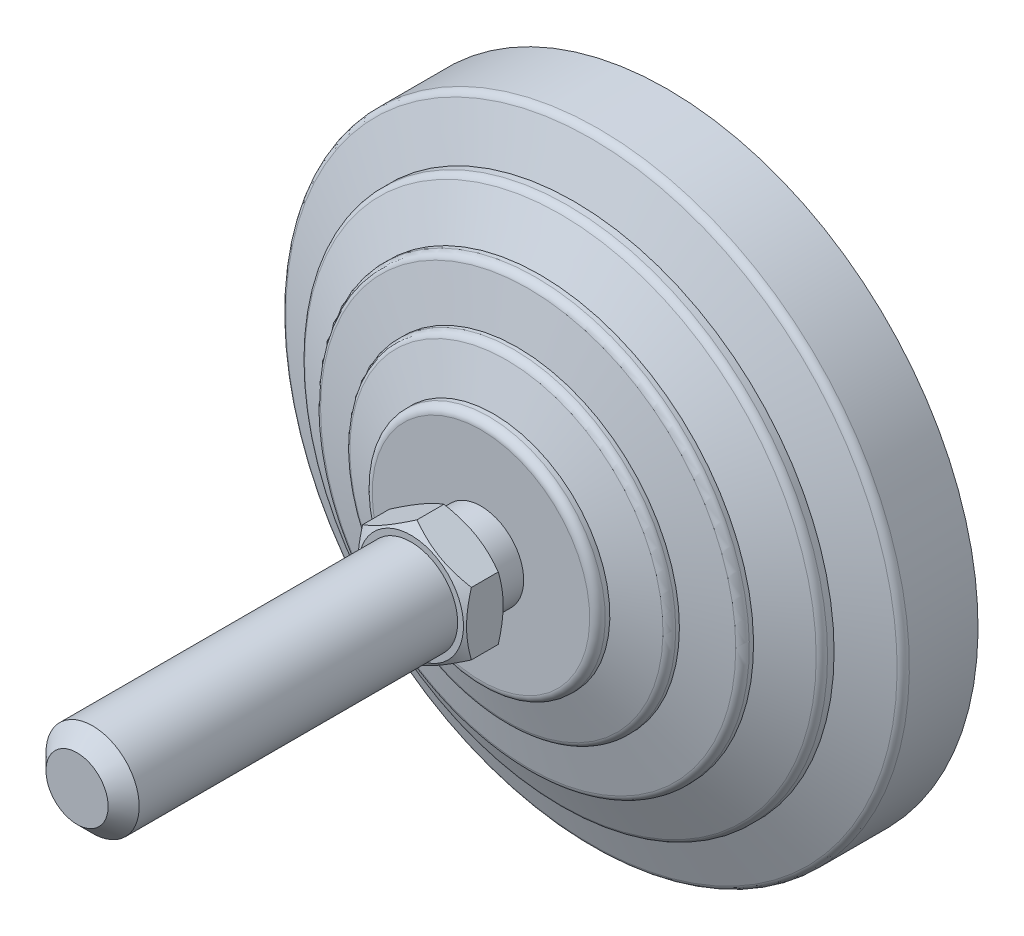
ISO-10303-21;
HEADER;
FILE_DESCRIPTION(('STEP AP214'),'2;1');
FILE_NAME('part.step','',(''),(''),'','','');
FILE_SCHEMA(('AUTOMOTIVE_DESIGN { 1 0 10303 214 1 1 1 1 }'));
ENDSEC;
DATA;
#1=APPLICATION_CONTEXT('core data for automotive mechanical design processes');
#2=APPLICATION_PROTOCOL_DEFINITION('international standard','automotive_design',2000,#1);
#3=PRODUCT_CONTEXT('',#1,'mechanical');
#4=PRODUCT('Part','Part','',(#3));
#5=PRODUCT_RELATED_PRODUCT_CATEGORY('part','',(#4));
#6=PRODUCT_DEFINITION_FORMATION('','',#4);
#7=PRODUCT_DEFINITION_CONTEXT('part definition',#1,'design');
#8=PRODUCT_DEFINITION('design','',#6,#7);
#9=PRODUCT_DEFINITION_SHAPE('','',#8);
#10=(LENGTH_UNIT() NAMED_UNIT(*) SI_UNIT(.MILLI.,.METRE.));
#11=(NAMED_UNIT(*) PLANE_ANGLE_UNIT() SI_UNIT($,.RADIAN.));
#12=(NAMED_UNIT(*) SI_UNIT($,.STERADIAN.) SOLID_ANGLE_UNIT());
#13=UNCERTAINTY_MEASURE_WITH_UNIT(LENGTH_MEASURE(1.E-05),#10,'distance_accuracy_value','');
#14=(GEOMETRIC_REPRESENTATION_CONTEXT(3) GLOBAL_UNCERTAINTY_ASSIGNED_CONTEXT((#13)) GLOBAL_UNIT_ASSIGNED_CONTEXT((#10,
#11,#12)) REPRESENTATION_CONTEXT('',''));
#15=CARTESIAN_POINT('',(0.,0.,0.));
#16=DIRECTION('',(0.,0.,1.));
#17=DIRECTION('',(1.,0.,0.));
#18=AXIS2_PLACEMENT_3D('',#15,#16,#17);
#19=CARTESIAN_POINT('',(-5.5000000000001,0.,28.));
#20=DIRECTION('',(0.,0.,1.));
#21=DIRECTION('',(0.,-1.,0.));
#22=AXIS2_PLACEMENT_3D('',#19,#20,#21);
#23=PLANE('',#22);
#24=CARTESIAN_POINT('',(0.,0.,28.));
#25=DIRECTION('',(0.,0.,-1.));
#26=DIRECTION('',(-1.,0.,0.));
#27=AXIS2_PLACEMENT_3D('',#24,#25,#26);
#28=CIRCLE('',#27,6.75);
#29=CARTESIAN_POINT('',(-6.75,0.,28.));
#30=VERTEX_POINT('',#29);
#31=EDGE_CURVE('E575',#30,#30,#28,.T.);
#32=ORIENTED_EDGE('',*,*,#31,.T.);
#33=EDGE_LOOP('',(#32));
#34=FACE_BOUND('',#33,.T.);
#35=CARTESIAN_POINT('',(0.,0.,28.));
#36=DIRECTION('',(0.,0.,-1.));
#37=DIRECTION('',(0.,1.,0.));
#38=AXIS2_PLACEMENT_3D('',#35,#36,#37);
#39=CIRCLE('',#38,5.5000000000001);
#40=CARTESIAN_POINT('',(0.,5.5000000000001,28.));
#41=VERTEX_POINT('',#40);
#42=EDGE_CURVE('E147',#41,#41,#39,.T.);
#43=ORIENTED_EDGE('',*,*,#42,.F.);
#44=EDGE_LOOP('',(#43));
#45=FACE_BOUND('',#44,.T.);
#46=ADVANCED_FACE('F14',(#34,#45),#23,.F.);
#47=CARTESIAN_POINT('',(0.,0.,0.));
#48=DIRECTION('',(0.,0.,-1.));
#49=DIRECTION('',(0.,1.,0.));
#50=AXIS2_PLACEMENT_3D('',#47,#48,#49);
#51=CYLINDRICAL_SURFACE('',#50,5.5000000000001);
#52=CARTESIAN_POINT('',(0.,0.,24.));
#53=DIRECTION('',(0.,0.,-1.));
#54=DIRECTION('',(0.,1.,0.));
#55=AXIS2_PLACEMENT_3D('',#52,#53,#54);
#56=CIRCLE('',#55,5.5000000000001);
#57=CARTESIAN_POINT('',(0.,5.5000000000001,24.));
#58=VERTEX_POINT('',#57);
#59=EDGE_CURVE('E144',#58,#58,#56,.T.);
#60=ORIENTED_EDGE('',*,*,#59,.F.);
#61=EDGE_LOOP('',(#60));
#62=FACE_BOUND('',#61,.T.);
#63=ORIENTED_EDGE('',*,*,#42,.T.);
#64=EDGE_LOOP('',(#63));
#65=FACE_BOUND('',#64,.T.);
#66=ADVANCED_FACE('F173',(#62,#65),#51,.T.);
#67=CARTESIAN_POINT('',(-5.5000000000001,0.,24.));
#68=DIRECTION('',(0.,0.,-1.));
#69=DIRECTION('',(0.,1.,0.));
#70=AXIS2_PLACEMENT_3D('',#67,#68,#69);
#71=PLANE('',#70);
#72=CARTESIAN_POINT('',(0.,0.,24.));
#73=DIRECTION('',(0.,0.,-1.));
#74=DIRECTION('',(0.,1.,0.));
#75=AXIS2_PLACEMENT_3D('',#72,#73,#74);
#76=CIRCLE('',#75,14.);
#77=CARTESIAN_POINT('',(0.,14.,24.));
#78=VERTEX_POINT('',#77);
#79=EDGE_CURVE('E141',#78,#78,#76,.T.);
#80=ORIENTED_EDGE('',*,*,#79,.F.);
#81=EDGE_LOOP('',(#80));
#82=FACE_BOUND('',#81,.T.);
#83=ORIENTED_EDGE('',*,*,#59,.T.);
#84=EDGE_LOOP('',(#83));
#85=FACE_BOUND('',#84,.T.);
#86=ADVANCED_FACE('F180',(#82,#85),#71,.F.);
#87=CARTESIAN_POINT('',(0.,0.,23.));
#88=DIRECTION('',(0.,0.,-1.));
#89=DIRECTION('',(0.,1.,0.));
#90=AXIS2_PLACEMENT_3D('',#87,#88,#89);
#91=TOROIDAL_SURFACE('',#90,14.,1.);
#92=CARTESIAN_POINT('',(0.,0.,23.));
#93=DIRECTION('',(0.,0.,-1.));
#94=DIRECTION('',(0.,1.,0.));
#95=AXIS2_PLACEMENT_3D('',#92,#93,#94);
#96=CIRCLE('',#95,15.);
#97=CARTESIAN_POINT('',(0.,15.,23.));
#98=VERTEX_POINT('',#97);
#99=EDGE_CURVE('E138',#98,#98,#96,.T.);
#100=ORIENTED_EDGE('',*,*,#99,.F.);
#101=EDGE_LOOP('',(#100));
#102=FACE_BOUND('',#101,.T.);
#103=ORIENTED_EDGE('',*,*,#79,.T.);
#104=EDGE_LOOP('',(#103));
#105=FACE_BOUND('',#104,.T.);
#106=ADVANCED_FACE('F407',(#102,#105),#91,.T.);
#107=CARTESIAN_POINT('',(0.,0.,0.));
#108=DIRECTION('',(0.,0.,-1.));
#109=DIRECTION('',(0.,1.,0.));
#110=AXIS2_PLACEMENT_3D('',#107,#108,#109);
#111=CYLINDRICAL_SURFACE('',#110,15.);
#112=CARTESIAN_POINT('',(0.,0.,22.4025287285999));
#113=DIRECTION('',(0.,0.,-1.));
#114=DIRECTION('',(0.,1.,0.));
#115=AXIS2_PLACEMENT_3D('',#112,#113,#114);
#116=CIRCLE('',#115,15.);
#117=CARTESIAN_POINT('',(0.,15.,22.4025287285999));
#118=VERTEX_POINT('',#117);
#119=EDGE_CURVE('E135',#118,#118,#116,.T.);
#120=ORIENTED_EDGE('',*,*,#119,.F.);
#121=EDGE_LOOP('',(#120));
#122=FACE_BOUND('',#121,.T.);
#123=ORIENTED_EDGE('',*,*,#99,.T.);
#124=EDGE_LOOP('',(#123));
#125=FACE_BOUND('',#124,.T.);
#126=ADVANCED_FACE('F397',(#122,#125),#111,.T.);
#127=CARTESIAN_POINT('',(0.,0.,22.4025287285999));
#128=DIRECTION('',(0.,0.,-1.));
#129=DIRECTION('',(0.,1.,0.));
#130=AXIS2_PLACEMENT_3D('',#127,#128,#129);
#131=CONICAL_SURFACE('',#130,15.,1.25589726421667);
#132=CARTESIAN_POINT('',(0.,0.,20.7216684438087));
#133=DIRECTION('',(0.,0.,-1.));
#134=DIRECTION('',(0.,1.,0.));
#135=AXIS2_PLACEMENT_3D('',#132,#133,#134);
#136=CIRCLE('',#135,20.16016354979);
#137=CARTESIAN_POINT('',(0.,20.16016354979,20.7216684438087));
#138=VERTEX_POINT('',#137);
#139=EDGE_CURVE('E132',#138,#138,#136,.T.);
#140=ORIENTED_EDGE('',*,*,#139,.F.);
#141=EDGE_LOOP('',(#140));
#142=FACE_BOUND('',#141,.T.);
#143=ORIENTED_EDGE('',*,*,#119,.T.);
#144=EDGE_LOOP('',(#143));
#145=FACE_BOUND('',#144,.T.);
#146=ADVANCED_FACE('F387',(#142,#145),#131,.T.);
#147=CARTESIAN_POINT('',(0.,0.,19.7708407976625));
#148=DIRECTION('',(0.,0.,-1.));
#149=DIRECTION('',(0.,1.,0.));
#150=AXIS2_PLACEMENT_3D('',#147,#148,#149);
#151=TOROIDAL_SURFACE('',#150,19.8504430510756,1.);
#152=CARTESIAN_POINT('',(0.,0.,19.7708407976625));
#153=DIRECTION('',(0.,0.,-1.));
#154=DIRECTION('',(0.,1.,0.));
#155=AXIS2_PLACEMENT_3D('',#152,#153,#154);
#156=CIRCLE('',#155,20.8504430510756);
#157=CARTESIAN_POINT('',(0.,20.8504430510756,19.7708407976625));
#158=VERTEX_POINT('',#157);
#159=EDGE_CURVE('E129',#158,#158,#156,.T.);
#160=ORIENTED_EDGE('',*,*,#159,.F.);
#161=EDGE_LOOP('',(#160));
#162=FACE_BOUND('',#161,.T.);
#163=ORIENTED_EDGE('',*,*,#139,.T.);
#164=EDGE_LOOP('',(#163));
#165=FACE_BOUND('',#164,.T.);
#166=ADVANCED_FACE('F377',(#162,#165),#151,.T.);
#167=CARTESIAN_POINT('',(0.,0.,0.));
#168=DIRECTION('',(0.,0.,-1.));
#169=DIRECTION('',(0.,1.,0.));
#170=AXIS2_PLACEMENT_3D('',#167,#168,#169);
#171=CYLINDRICAL_SURFACE('',#170,20.8504430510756);
#172=CARTESIAN_POINT('',(0.,0.,19.2987385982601));
#173=DIRECTION('',(0.,0.,-1.));
#174=DIRECTION('',(0.,1.,0.));
#175=AXIS2_PLACEMENT_3D('',#172,#173,#174);
#176=CIRCLE('',#175,20.8504430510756);
#177=CARTESIAN_POINT('',(0.,20.8504430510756,19.2987385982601));
#178=VERTEX_POINT('',#177);
#179=EDGE_CURVE('E126',#178,#178,#176,.T.);
#180=ORIENTED_EDGE('',*,*,#179,.F.);
#181=EDGE_LOOP('',(#180));
#182=FACE_BOUND('',#181,.T.);
#183=ORIENTED_EDGE('',*,*,#159,.T.);
#184=EDGE_LOOP('',(#183));
#185=FACE_BOUND('',#184,.T.);
#186=ADVANCED_FACE('F367',(#182,#185),#171,.T.);
#187=CARTESIAN_POINT('',(0.,0.,19.2987385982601));
#188=DIRECTION('',(0.,0.,-1.));
#189=DIRECTION('',(0.,1.,0.));
#190=AXIS2_PLACEMENT_3D('',#187,#188,#189);
#191=CONICAL_SURFACE('',#190,20.8504430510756,1.34067144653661);
#192=CARTESIAN_POINT('',(0.,0.,17.9217501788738));
#193=DIRECTION('',(0.,0.,-1.));
#194=DIRECTION('',(0.,1.,0.));
#195=AXIS2_PLACEMENT_3D('',#192,#193,#194);
#196=CIRCLE('',#195,26.7280991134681);
#197=CARTESIAN_POINT('',(0.,26.7280991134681,17.9217501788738));
#198=VERTEX_POINT('',#197);
#199=EDGE_CURVE('E123',#198,#198,#196,.T.);
#200=ORIENTED_EDGE('',*,*,#199,.F.);
#201=EDGE_LOOP('',(#200));
#202=FACE_BOUND('',#201,.T.);
#203=ORIENTED_EDGE('',*,*,#179,.T.);
#204=EDGE_LOOP('',(#203));
#205=FACE_BOUND('',#204,.T.);
#206=ADVANCED_FACE('F357',(#202,#205),#191,.T.);
#207=CARTESIAN_POINT('',(0.,0.,16.9481122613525));
#208=DIRECTION('',(0.,0.,-1.));
#209=DIRECTION('',(0.,1.,0.));
#210=AXIS2_PLACEMENT_3D('',#207,#208,#209);
#211=TOROIDAL_SURFACE('',#210,26.5,1.00000000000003);
#212=CARTESIAN_POINT('',(0.,0.,16.9481122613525));
#213=DIRECTION('',(0.,0.,-1.));
#214=DIRECTION('',(0.,1.,0.));
#215=AXIS2_PLACEMENT_3D('',#212,#213,#214);
#216=CIRCLE('',#215,27.5);
#217=CARTESIAN_POINT('',(0.,27.5,16.9481122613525));
#218=VERTEX_POINT('',#217);
#219=EDGE_CURVE('E120',#218,#218,#216,.T.);
#220=ORIENTED_EDGE('',*,*,#219,.F.);
#221=EDGE_LOOP('',(#220));
#222=FACE_BOUND('',#221,.T.);
#223=ORIENTED_EDGE('',*,*,#199,.T.);
#224=EDGE_LOOP('',(#223));
#225=FACE_BOUND('',#224,.T.);
#226=ADVANCED_FACE('F347',(#222,#225),#211,.T.);
#227=CARTESIAN_POINT('',(0.,0.,0.));
#228=DIRECTION('',(0.,0.,-1.));
#229=DIRECTION('',(0.,1.,0.));
#230=AXIS2_PLACEMENT_3D('',#227,#228,#229);
#231=CYLINDRICAL_SURFACE('',#230,27.5);
#232=CARTESIAN_POINT('',(0.,0.,16.4025287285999));
#233=DIRECTION('',(0.,0.,-1.));
#234=DIRECTION('',(0.,1.,0.));
#235=AXIS2_PLACEMENT_3D('',#232,#233,#234);
#236=CIRCLE('',#235,27.5);
#237=CARTESIAN_POINT('',(0.,27.5,16.4025287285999));
#238=VERTEX_POINT('',#237);
#239=EDGE_CURVE('E117',#238,#238,#236,.T.);
#240=ORIENTED_EDGE('',*,*,#239,.F.);
#241=EDGE_LOOP('',(#240));
#242=FACE_BOUND('',#241,.T.);
#243=ORIENTED_EDGE('',*,*,#219,.T.);
#244=EDGE_LOOP('',(#243));
#245=FACE_BOUND('',#244,.T.);
#246=ADVANCED_FACE('F337',(#242,#245),#231,.T.);
#247=CARTESIAN_POINT('',(0.,0.,16.4025287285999));
#248=DIRECTION('',(0.,0.,-1.));
#249=DIRECTION('',(0.,1.,0.));
#250=AXIS2_PLACEMENT_3D('',#247,#248,#249);
#251=CONICAL_SURFACE('',#250,27.5,1.1202291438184);
#252=CARTESIAN_POINT('',(0.,0.,13.7730910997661));
#253=DIRECTION('',(0.,0.,-1.));
#254=DIRECTION('',(0.,1.,0.));
#255=AXIS2_PLACEMENT_3D('',#252,#253,#254);
#256=CIRCLE('',#255,32.9354761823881);
#257=CARTESIAN_POINT('',(0.,32.9354761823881,13.7730910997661));
#258=VERTEX_POINT('',#257);
#259=EDGE_CURVE('E114',#258,#258,#256,.T.);
#260=ORIENTED_EDGE('',*,*,#259,.F.);
#261=EDGE_LOOP('',(#260));
#262=FACE_BOUND('',#261,.T.);
#263=ORIENTED_EDGE('',*,*,#239,.T.);
#264=EDGE_LOOP('',(#263));
#265=FACE_BOUND('',#264,.T.);
#266=ADVANCED_FACE('F327',(#262,#265),#251,.T.);
#267=CARTESIAN_POINT('',(0.,0.,12.8728908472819));
#268=DIRECTION('',(0.,0.,-1.));
#269=DIRECTION('',(0.,1.,0.));
#270=AXIS2_PLACEMENT_3D('',#267,#268,#269);
#271=TOROIDAL_SURFACE('',#270,32.5,0.999999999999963);
#272=CARTESIAN_POINT('',(0.,0.,12.8728908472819));
#273=DIRECTION('',(0.,0.,-1.));
#274=DIRECTION('',(0.,1.,0.));
#275=AXIS2_PLACEMENT_3D('',#272,#273,#274);
#276=CIRCLE('',#275,33.5);
#277=CARTESIAN_POINT('',(0.,33.5,12.8728908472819));
#278=VERTEX_POINT('',#277);
#279=EDGE_CURVE('E111',#278,#278,#276,.T.);
#280=ORIENTED_EDGE('',*,*,#279,.F.);
#281=EDGE_LOOP('',(#280));
#282=FACE_BOUND('',#281,.T.);
#283=ORIENTED_EDGE('',*,*,#259,.T.);
#284=EDGE_LOOP('',(#283));
#285=FACE_BOUND('',#284,.T.);
#286=ADVANCED_FACE('F317',(#282,#285),#271,.T.);
#287=CARTESIAN_POINT('',(0.,0.,0.));
#288=DIRECTION('',(0.,0.,-1.));
#289=DIRECTION('',(0.,1.,0.));
#290=AXIS2_PLACEMENT_3D('',#287,#288,#289);
#291=CYLINDRICAL_SURFACE('',#290,33.5);
#292=CARTESIAN_POINT('',(0.,0.,12.0315037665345));
#293=DIRECTION('',(0.,0.,-1.));
#294=DIRECTION('',(0.,1.,0.));
#295=AXIS2_PLACEMENT_3D('',#292,#293,#294);
#296=CIRCLE('',#295,33.5);
#297=CARTESIAN_POINT('',(0.,33.5,12.0315037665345));
#298=VERTEX_POINT('',#297);
#299=EDGE_CURVE('E108',#298,#298,#296,.T.);
#300=ORIENTED_EDGE('',*,*,#299,.F.);
#301=EDGE_LOOP('',(#300));
#302=FACE_BOUND('',#301,.T.);
#303=ORIENTED_EDGE('',*,*,#279,.T.);
#304=EDGE_LOOP('',(#303));
#305=FACE_BOUND('',#304,.T.);
#306=ADVANCED_FACE('F307',(#302,#305),#291,.T.);
#307=CARTESIAN_POINT('',(0.,0.,12.0315037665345));
#308=DIRECTION('',(0.,0.,-1.));
#309=DIRECTION('',(0.,1.,0.));
#310=AXIS2_PLACEMENT_3D('',#307,#308,#309);
#311=CONICAL_SURFACE('',#310,33.5,1.20362249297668);
#312=CARTESIAN_POINT('',(0.,0.,9.77805027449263));
#313=DIRECTION('',(0.,0.,-1.));
#314=DIRECTION('',(0.,1.,0.));
#315=AXIS2_PLACEMENT_3D('',#312,#313,#314);
#316=CIRCLE('',#315,39.3589790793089);
#317=CARTESIAN_POINT('',(0.,39.3589790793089,9.77805027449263));
#318=VERTEX_POINT('',#317);
#319=EDGE_CURVE('E105',#318,#318,#316,.T.);
#320=ORIENTED_EDGE('',*,*,#319,.F.);
#321=EDGE_LOOP('',(#320));
#322=FACE_BOUND('',#321,.T.);
#323=ORIENTED_EDGE('',*,*,#299,.T.);
#324=EDGE_LOOP('',(#323));
#325=FACE_BOUND('',#324,.T.);
#326=ADVANCED_FACE('F297',(#322,#325),#311,.T.);
#327=CARTESIAN_POINT('',(0.,0.,8.84470466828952));
#328=DIRECTION('',(0.,0.,-1.));
#329=DIRECTION('',(0.,1.,0.));
#330=AXIS2_PLACEMENT_3D('',#327,#328,#329);
#331=TOROIDAL_SURFACE('',#330,39.,1.00000000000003);
#332=CARTESIAN_POINT('',(0.,0.,8.84470466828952));
#333=DIRECTION('',(0.,0.,-1.));
#334=DIRECTION('',(0.,1.,0.));
#335=AXIS2_PLACEMENT_3D('',#332,#333,#334);
#336=CIRCLE('',#335,40.);
#337=CARTESIAN_POINT('',(0.,40.,8.84470466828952));
#338=VERTEX_POINT('',#337);
#339=EDGE_CURVE('E102',#338,#338,#336,.T.);
#340=ORIENTED_EDGE('',*,*,#339,.F.);
#341=EDGE_LOOP('',(#340));
#342=FACE_BOUND('',#341,.T.);
#343=ORIENTED_EDGE('',*,*,#319,.T.);
#344=EDGE_LOOP('',(#343));
#345=FACE_BOUND('',#344,.T.);
#346=ADVANCED_FACE('F287',(#342,#345),#331,.T.);
#347=CARTESIAN_POINT('',(0.,0.,0.));
#348=DIRECTION('',(0.,0.,-1.));
#349=DIRECTION('',(0.,1.,0.));
#350=AXIS2_PLACEMENT_3D('',#347,#348,#349);
#351=CYLINDRICAL_SURFACE('',#350,40.);
#352=CARTESIAN_POINT('',(0.,0.,0.));
#353=DIRECTION('',(0.,0.,-1.));
#354=DIRECTION('',(0.,1.,0.));
#355=AXIS2_PLACEMENT_3D('',#352,#353,#354);
#356=CIRCLE('',#355,40.);
#357=CARTESIAN_POINT('',(0.,40.,0.));
#358=VERTEX_POINT('',#357);
#359=EDGE_CURVE('E99',#358,#358,#356,.T.);
#360=ORIENTED_EDGE('',*,*,#359,.F.);
#361=EDGE_LOOP('',(#360));
#362=FACE_BOUND('',#361,.T.);
#363=ORIENTED_EDGE('',*,*,#339,.T.);
#364=EDGE_LOOP('',(#363));
#365=FACE_BOUND('',#364,.T.);
#366=ADVANCED_FACE('F277',(#362,#365),#351,.T.);
#367=CARTESIAN_POINT('',(0.,0.,0.));
#368=DIRECTION('',(0.,0.,1.));
#369=DIRECTION('',(0.,-1.,0.));
#370=AXIS2_PLACEMENT_3D('',#367,#368,#369);
#371=PLANE('',#370);
#372=ORIENTED_EDGE('',*,*,#359,.T.);
#373=EDGE_LOOP('',(#372));
#374=FACE_BOUND('',#373,.T.);
#375=ADVANCED_FACE('F169',(#374),#371,.F.);
#376=CARTESIAN_POINT('',(0.,0.,29.6680379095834));
#377=DIRECTION('',(0.,0.,1.));
#378=DIRECTION('',(1.,0.,0.));
#379=AXIS2_PLACEMENT_3D('',#376,#377,#378);
#380=CONICAL_SURFACE('',#379,9.63912640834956,1.0471975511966);
#381=CARTESIAN_POINT('',(0.000200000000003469,-8.0830192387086,28.7696190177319));
#382=CARTESIAN_POINT('',(-0.153667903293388,-7.99418356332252,28.7183374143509));
#383=CARTESIAN_POINT('',(-0.308109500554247,-7.90501666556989,28.669383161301));
#384=CARTESIAN_POINT('',(-0.618246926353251,-7.72595873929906,28.5767703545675));
#385=CARTESIAN_POINT('',(-0.773943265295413,-7.63606741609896,28.5331140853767));
#386=CARTESIAN_POINT('',(-1.24352516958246,-7.36495417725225,28.4109491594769));
#387=CARTESIAN_POINT('',(-1.5592643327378,-7.18266208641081,28.3414631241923));
#388=CARTESIAN_POINT('',(-2.03176224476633,-6.90986528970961,28.2599825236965));
#389=CARTESIAN_POINT('',(-2.18710922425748,-6.82017566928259,28.2367710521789));
#390=CARTESIAN_POINT('',(-2.49850511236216,-6.64039116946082,28.1978487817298));
#391=CARTESIAN_POINT('',(-2.65455395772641,-6.55029632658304,28.1821373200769));
#392=CARTESIAN_POINT('',(-2.96692267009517,-6.36995016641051,28.1586154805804));
#393=CARTESIAN_POINT('',(-3.12324202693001,-6.27969914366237,28.1507961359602));
#394=CARTESIAN_POINT('',(-3.43601650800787,-6.09911871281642,28.1432178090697));
#395=CARTESIAN_POINT('',(-3.59247162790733,-6.00878930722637,28.1434585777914));
#396=CARTESIAN_POINT('',(-4.02110687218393,-5.76131663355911,28.155197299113));
#397=CARTESIAN_POINT('',(-4.2931466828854,-5.60425437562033,28.1749033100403));
#398=CARTESIAN_POINT('',(-4.8354194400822,-5.29117305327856,28.2373910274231));
#399=CARTESIAN_POINT('',(-5.10565047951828,-5.13515508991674,28.2801940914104));
#400=CARTESIAN_POINT('',(-5.64901454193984,-4.82144370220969,28.3871892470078));
#401=CARTESIAN_POINT('',(-5.92207900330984,-4.6637898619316,28.4518346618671));
#402=CARTESIAN_POINT('',(-6.46413578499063,-4.35083323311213,28.5985536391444));
#403=CARTESIAN_POINT('',(-6.73313504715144,-4.19552643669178,28.680592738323));
#404=CARTESIAN_POINT('',(-7.0002,-4.04133641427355,28.7696190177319));
#405=B_SPLINE_CURVE_WITH_KNOTS('',3,(#381,#382,#383,#384,#385,#386,#387,#388,#389,#390,#391,
#392,#393,#394,#395,#396,#397,#398,#399,#400,#401,#402,#403,#404),.UNSPECIFIED.,.F.,.F.,(4,2,2,
2,2,2,2,2,2,2,2,4),(0.,0.554727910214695,1.10969417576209,2.2219327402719,2.76443041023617,
3.30688013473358,3.8487128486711,4.39052882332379,5.33376515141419,6.27787517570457,
7.2429241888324,8.20607866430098),.UNSPECIFIED.);
#406=CARTESIAN_POINT('',(0.,-8.08290376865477,28.7695523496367));
#407=VERTEX_POINT('',#406);
#408=CARTESIAN_POINT('',(-7.,-4.04145188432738,28.7695523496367));
#409=VERTEX_POINT('',#408);
#410=EDGE_CURVE('E73',#407,#409,#405,.T.);
#411=ORIENTED_EDGE('',*,*,#410,.T.);
#412=CARTESIAN_POINT('',(-7.,-10.8234818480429,31.5448334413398));
#413=CARTESIAN_POINT('',(-7.,-10.5180146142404,31.3967848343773));
#414=CARTESIAN_POINT('',(-7.,-10.211842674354,31.250165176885));
#415=CARTESIAN_POINT('',(-7.,-9.59771448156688,30.9605880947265));
#416=CARTESIAN_POINT('',(-7.,-9.28975795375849,30.8176312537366));
#417=CARTESIAN_POINT('',(-7.,-8.67008343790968,30.5354579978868));
#418=CARTESIAN_POINT('',(-7.,-8.35835407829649,30.3962664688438));
#419=CARTESIAN_POINT('',(-7.,-7.7324046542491,30.1236230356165));
#420=CARTESIAN_POINT('',(-7.,-7.41818470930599,29.9901708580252));
#421=CARTESIAN_POINT('',(-7.,-6.77673935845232,29.7264043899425));
#422=CARTESIAN_POINT('',(-7.,-6.44941739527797,29.5963236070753));
#423=CARTESIAN_POINT('',(-7.,-5.79093289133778,29.3460855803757));
#424=CARTESIAN_POINT('',(-7.,-5.45976992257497,29.225929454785));
#425=CARTESIAN_POINT('',(-7.,-4.79370289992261,28.9987191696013));
#426=CARTESIAN_POINT('',(-7.,-4.45880808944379,28.8916382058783));
#427=CARTESIAN_POINT('',(-7.,-3.78422694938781,28.6940341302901));
#428=CARTESIAN_POINT('',(-7.,-3.44454217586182,28.6035057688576));
#429=CARTESIAN_POINT('',(-7.,-2.76200958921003,28.4438581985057));
#430=CARTESIAN_POINT('',(-7.,-2.41918937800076,28.3746241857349));
#431=CARTESIAN_POINT('',(-7.,-1.90186328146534,28.2897576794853));
#432=CARTESIAN_POINT('',(-7.,-1.7288923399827,28.2646317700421));
#433=CARTESIAN_POINT('',(-7.,-1.38210174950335,28.2212016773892));
#434=CARTESIAN_POINT('',(-7.,-1.20828218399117,28.2028968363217));
#435=CARTESIAN_POINT('',(-7.,-0.862283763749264,28.1737014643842));
#436=CARTESIAN_POINT('',(-7.,-0.690112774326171,28.1627180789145));
#437=CARTESIAN_POINT('',(-7.,-0.345460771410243,28.148039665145));
#438=CARTESIAN_POINT('',(-7.,-0.172979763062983,28.1443445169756));
#439=CARTESIAN_POINT('',(-7.,0.171984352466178,28.1443306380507));
#440=CARTESIAN_POINT('',(-7.,0.344467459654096,28.1480119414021));
#441=CARTESIAN_POINT('',(-7.,0.689126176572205,28.1626615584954));
#442=CARTESIAN_POINT('',(-7.,0.86130177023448,28.1736302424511));
#443=CARTESIAN_POINT('',(-7.,1.27607689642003,28.2086010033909));
#444=CARTESIAN_POINT('',(-7.,1.51838644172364,28.2361153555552));
#445=CARTESIAN_POINT('',(-7.,2.0011743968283,28.3040687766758));
#446=CARTESIAN_POINT('',(-7.,2.24165254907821,28.3445096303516));
#447=CARTESIAN_POINT('',(-7.,2.96008329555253,28.4830747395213));
#448=CARTESIAN_POINT('',(-7.,3.43475744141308,28.5984153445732));
#449=CARTESIAN_POINT('',(-7.,4.14448104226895,28.7980159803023));
#450=CARTESIAN_POINT('',(-7.,4.38322207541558,28.8699012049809));
#451=CARTESIAN_POINT('',(-7.,4.85838459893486,29.0210356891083));
#452=CARTESIAN_POINT('',(-7.,5.09480607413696,29.1002849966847));
#453=CARTESIAN_POINT('',(-7.,5.56540584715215,29.2648846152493));
#454=CARTESIAN_POINT('',(-7.,5.79958487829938,29.3502328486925));
#455=CARTESIAN_POINT('',(-7.,6.26600957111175,29.5260363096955));
#456=CARTESIAN_POINT('',(-7.,6.49825525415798,29.6164914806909));
#457=CARTESIAN_POINT('',(-7.,7.04118817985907,29.8337326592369));
#458=CARTESIAN_POINT('',(-7.,7.35118126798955,29.9622501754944));
#459=CARTESIAN_POINT('',(-7.,7.96857654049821,30.2253821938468));
#460=CARTESIAN_POINT('',(-7.,8.27597857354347,30.3599970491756));
#461=CARTESIAN_POINT('',(-7.,8.88866156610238,30.6341136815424));
#462=CARTESIAN_POINT('',(-7.,9.19394210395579,30.773616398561));
#463=CARTESIAN_POINT('',(-7.,9.80268418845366,31.0565425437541));
#464=CARTESIAN_POINT('',(-7.,10.1061456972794,31.199966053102));
#465=CARTESIAN_POINT('',(-7.,10.7118512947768,31.4901531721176));
#466=CARTESIAN_POINT('',(-7.,11.0140937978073,31.6369200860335));
#467=CARTESIAN_POINT('',(-7.,11.6172863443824,31.9330886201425));
#468=CARTESIAN_POINT('',(-7.,11.9182363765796,32.0824902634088));
#469=CARTESIAN_POINT('',(-7.,12.8193764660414,32.5339155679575));
#470=CARTESIAN_POINT('',(-7.,13.4179343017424,32.8391971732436));
#471=CARTESIAN_POINT('',(-7.,14.5626517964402,33.4304667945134));
#472=CARTESIAN_POINT('',(-7.,15.1090628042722,33.7159703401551));
#473=CARTESIAN_POINT('',(-7.,16.199850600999,34.2908789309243));
#474=CARTESIAN_POINT('',(-7.,16.7442273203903,34.5802841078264));
#475=CARTESIAN_POINT('',(-7.,17.8300738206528,35.1613666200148));
#476=CARTESIAN_POINT('',(-7.,18.37154744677,35.4530367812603));
#477=CARTESIAN_POINT('',(-7.,19.4531911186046,36.03871640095));
#478=CARTESIAN_POINT('',(-7.,19.9933612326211,36.3327257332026));
#479=CARTESIAN_POINT('',(-7.,20.5330501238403,36.6276098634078));
#480=B_SPLINE_CURVE_WITH_KNOTS('',3,(#412,#413,#414,#415,#416,#417,#418,#419,#420,#421,#422,
#423,#424,#425,#426,#427,#428,#429,#430,#431,#432,#433,#434,#435,#436,#437,#438,#439,#440,#441,
#442,#443,#444,#445,#446,#447,#448,#449,#450,#451,#452,#453,#454,#455,#456,#457,#458,#459,#460,
#461,#462,#463,#464,#465,#466,#467,#468,#469,#470,#471,#472,#473,#474,#475,#476,#477,#478,#479),
.UNSPECIFIED.,.F.,.F.,(4,2,2,2,2,2,2,2,2,2,2,2,2,2,2,2,2,2,2,2,2,2,2,2,2,2,2,2,2,2,2,2,2,4),(0.,
1.01837283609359,2.03690695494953,3.06104090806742,4.08512602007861,5.14166861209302,
6.19833008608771,7.25278767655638,8.30691026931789,9.3552459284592,9.87949154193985,
10.403686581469,10.9211001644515,11.4385052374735,11.9559127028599,12.4733464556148,
13.2045326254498,13.9358197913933,15.3992183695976,16.1471431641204,16.8950728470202,
17.6427489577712,18.3904167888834,19.3970628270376,20.4037672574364,21.4106663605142,
22.4175863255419,23.4255487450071,24.4335199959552,26.4492033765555,28.2986987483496,
30.1482567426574,31.993348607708,33.8383416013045),.UNSPECIFIED.);
#481=CARTESIAN_POINT('',(-7.,4.04145188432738,28.7695523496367));
#482=VERTEX_POINT('',#481);
#483=EDGE_CURVE('E81',#409,#482,#480,.T.);
#484=ORIENTED_EDGE('',*,*,#483,.T.);
#485=CARTESIAN_POINT('',(-7.0002,4.04133641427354,28.7696190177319));
#486=CARTESIAN_POINT('',(-6.84633209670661,4.13017208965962,28.7183374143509));
#487=CARTESIAN_POINT('',(-6.69189049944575,4.21933898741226,28.669383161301));
#488=CARTESIAN_POINT('',(-6.38175307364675,4.39839691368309,28.5767703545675));
#489=CARTESIAN_POINT('',(-6.22605673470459,4.48828823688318,28.5331140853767));
#490=CARTESIAN_POINT('',(-5.75647483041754,4.75940147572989,28.4109491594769));
#491=CARTESIAN_POINT('',(-5.4407356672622,4.94169356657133,28.3414631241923));
#492=CARTESIAN_POINT('',(-4.96823775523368,5.21449036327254,28.2599825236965));
#493=CARTESIAN_POINT('',(-4.81289077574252,5.30417998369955,28.2367710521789));
#494=CARTESIAN_POINT('',(-4.50149488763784,5.48396448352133,28.1978487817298));
#495=CARTESIAN_POINT('',(-4.3454460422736,5.57405932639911,28.1821373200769));
#496=CARTESIAN_POINT('',(-4.03307732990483,5.75440548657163,28.1586154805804));
#497=CARTESIAN_POINT('',(-3.87675797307,5.84465650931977,28.1507961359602));
#498=CARTESIAN_POINT('',(-3.56398349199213,6.02523694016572,28.1432178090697));
#499=CARTESIAN_POINT('',(-3.40752837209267,6.11556634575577,28.1434585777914));
#500=CARTESIAN_POINT('',(-2.97889312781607,6.36303901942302,28.155197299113));
#501=CARTESIAN_POINT('',(-2.7068533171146,6.52010127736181,28.1749033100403));
#502=CARTESIAN_POINT('',(-2.1645805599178,6.83318259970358,28.2373910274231));
#503=CARTESIAN_POINT('',(-1.89434952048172,6.9892005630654,28.2801940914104));
#504=CARTESIAN_POINT('',(-1.35098545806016,7.30291195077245,28.3871892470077));
#505=CARTESIAN_POINT('',(-1.07792099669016,7.46056579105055,28.451834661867));
#506=CARTESIAN_POINT('',(-0.53586421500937,7.77352241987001,28.5985536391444));
#507=CARTESIAN_POINT('',(-0.266864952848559,7.92882921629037,28.680592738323));
#508=CARTESIAN_POINT('',(0.000199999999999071,8.0830192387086,28.7696190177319));
#509=B_SPLINE_CURVE_WITH_KNOTS('',3,(#485,#486,#487,#488,#489,#490,#491,#492,#493,#494,#495,
#496,#497,#498,#499,#500,#501,#502,#503,#504,#505,#506,#507,#508),.UNSPECIFIED.,.F.,.F.,(4,2,2,
2,2,2,2,2,2,2,2,4),(0.,0.554727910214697,1.10969417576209,2.2219327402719,2.76443041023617,
3.30688013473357,3.8487128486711,4.39052882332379,5.33376515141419,6.27787517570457,
7.2429241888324,8.20607866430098),.UNSPECIFIED.);
#510=CARTESIAN_POINT('',(0.,8.08290376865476,28.7695523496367));
#511=VERTEX_POINT('',#510);
#512=EDGE_CURVE('E530',#482,#511,#509,.T.);
#513=ORIENTED_EDGE('',*,*,#512,.T.);
#514=CARTESIAN_POINT('',(-0.000200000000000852,8.0830192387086,28.7696190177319));
#515=CARTESIAN_POINT('',(0.153667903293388,7.99418356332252,28.7183374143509));
#516=CARTESIAN_POINT('',(0.308109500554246,7.90501666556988,28.669383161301));
#517=CARTESIAN_POINT('',(0.61824692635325,7.72595873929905,28.5767703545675));
#518=CARTESIAN_POINT('',(0.773943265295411,7.63606741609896,28.5331140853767));
#519=CARTESIAN_POINT('',(1.24352516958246,7.36495417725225,28.4109491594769));
#520=CARTESIAN_POINT('',(1.5592643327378,7.18266208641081,28.3414631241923));
#521=CARTESIAN_POINT('',(2.03176224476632,6.9098652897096,28.2599825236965));
#522=CARTESIAN_POINT('',(2.18710922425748,6.82017566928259,28.2367710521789));
#523=CARTESIAN_POINT('',(2.49850511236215,6.64039116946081,28.1978487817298));
#524=CARTESIAN_POINT('',(2.6545539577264,6.55029632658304,28.1821373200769));
#525=CARTESIAN_POINT('',(2.96692267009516,6.36995016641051,28.1586154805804));
#526=CARTESIAN_POINT('',(3.12324202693,6.27969914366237,28.1507961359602));
#527=CARTESIAN_POINT('',(3.43601650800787,6.09911871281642,28.1432178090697));
#528=CARTESIAN_POINT('',(3.59247162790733,6.00878930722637,28.1434585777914));
#529=CARTESIAN_POINT('',(4.02110687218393,5.76131663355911,28.155197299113));
#530=CARTESIAN_POINT('',(4.29314668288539,5.60425437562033,28.1749033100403));
#531=CARTESIAN_POINT('',(4.83541944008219,5.29117305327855,28.2373910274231));
#532=CARTESIAN_POINT('',(5.10565047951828,5.13515508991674,28.2801940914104));
#533=CARTESIAN_POINT('',(5.64901454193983,4.82144370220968,28.3871892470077));
#534=CARTESIAN_POINT('',(5.92207900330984,4.66378986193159,28.4518346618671));
#535=CARTESIAN_POINT('',(6.46413578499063,4.35083323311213,28.5985536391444));
#536=CARTESIAN_POINT('',(6.73313504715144,4.19552643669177,28.680592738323));
#537=CARTESIAN_POINT('',(7.0002,4.04133641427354,28.7696190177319));
#538=B_SPLINE_CURVE_WITH_KNOTS('',3,(#514,#515,#516,#517,#518,#519,#520,#521,#522,#523,#524,
#525,#526,#527,#528,#529,#530,#531,#532,#533,#534,#535,#536,#537),.UNSPECIFIED.,.F.,.F.,(4,2,2,
2,2,2,2,2,2,2,2,4),(0.,0.554727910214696,1.10969417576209,2.2219327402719,2.76443041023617,
3.30688013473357,3.84871284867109,4.39052882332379,5.33376515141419,6.27787517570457,
7.2429241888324,8.20607866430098),.UNSPECIFIED.);
#539=CARTESIAN_POINT('',(7.,4.04145188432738,28.7695523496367));
#540=VERTEX_POINT('',#539);
#541=EDGE_CURVE('E525',#511,#540,#538,.T.);
#542=ORIENTED_EDGE('',*,*,#541,.T.);
#543=CARTESIAN_POINT('',(7.,-10.823481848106,31.5448334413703));
#544=CARTESIAN_POINT('',(7.,-10.5180146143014,31.3967848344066));
#545=CARTESIAN_POINT('',(7.,-10.2118426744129,31.250165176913));
#546=CARTESIAN_POINT('',(7.,-9.59771448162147,30.9605880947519));
#547=CARTESIAN_POINT('',(7.,-9.28975795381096,30.8176312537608));
#548=CARTESIAN_POINT('',(7.,-8.67008343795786,30.5354579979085));
#549=CARTESIAN_POINT('',(7.,-8.3583540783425,30.3962664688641));
#550=CARTESIAN_POINT('',(7.,-7.73240465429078,30.1236230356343));
#551=CARTESIAN_POINT('',(7.,-7.4181847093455,29.9901708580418));
#552=CARTESIAN_POINT('',(7.,-6.77673935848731,29.7264043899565));
#553=CARTESIAN_POINT('',(7.,-6.44941739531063,29.5963236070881));
#554=CARTESIAN_POINT('',(7.,-5.79093289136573,29.346085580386));
#555=CARTESIAN_POINT('',(7.,-5.45976992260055,29.225929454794));
#556=CARTESIAN_POINT('',(7.,-4.79370289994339,28.998719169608));
#557=CARTESIAN_POINT('',(7.,-4.45880808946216,28.891638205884));
#558=CARTESIAN_POINT('',(7.,-3.78422694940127,28.6940341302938));
#559=CARTESIAN_POINT('',(7.,-3.4445421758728,28.6035057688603));
#560=CARTESIAN_POINT('',(7.,-2.76200958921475,28.4438581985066));
#561=CARTESIAN_POINT('',(7.,-2.41918937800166,28.374624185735));
#562=CARTESIAN_POINT('',(7.,-1.90186328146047,28.2897576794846));
#563=CARTESIAN_POINT('',(7.,-1.72889233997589,28.2646317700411));
#564=CARTESIAN_POINT('',(7.,-1.38210174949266,28.2212016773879));
#565=CARTESIAN_POINT('',(7.,-1.20828218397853,28.2028968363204));
#566=CARTESIAN_POINT('',(7.,-0.862283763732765,28.173701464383));
#567=CARTESIAN_POINT('',(7.,-0.690112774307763,28.1627180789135));
#568=CARTESIAN_POINT('',(7.,-0.34546077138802,28.1480396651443));
#569=CARTESIAN_POINT('',(7.,-0.172979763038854,28.1443445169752));
#570=CARTESIAN_POINT('',(7.,0.171984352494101,28.144330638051));
#571=CARTESIAN_POINT('',(7.,0.344467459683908,28.148011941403));
#572=CARTESIAN_POINT('',(7.,0.689126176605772,28.1626615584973));
#573=CARTESIAN_POINT('',(7.,0.861301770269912,28.1736302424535));
#574=CARTESIAN_POINT('',(7.,1.27607689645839,28.2086010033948));
#575=CARTESIAN_POINT('',(7.,1.51838644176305,28.23611535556));
#576=CARTESIAN_POINT('',(7.,2.00117439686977,28.3040687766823));
#577=CARTESIAN_POINT('',(7.,2.24165254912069,28.3445096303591));
#578=CARTESIAN_POINT('',(7.,2.96008329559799,28.4830747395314));
#579=CARTESIAN_POINT('',(7.,3.43475744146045,28.5984153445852));
#580=CARTESIAN_POINT('',(7.,4.14448104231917,28.7980159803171));
#581=CARTESIAN_POINT('',(7.,4.38322207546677,28.8699012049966));
#582=CARTESIAN_POINT('',(7.,4.85838459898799,29.0210356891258));
#583=CARTESIAN_POINT('',(7.,5.09480607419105,29.1002849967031));
#584=CARTESIAN_POINT('',(7.,5.56540584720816,29.2648846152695));
#585=CARTESIAN_POINT('',(7.,5.79958487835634,29.3502328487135));
#586=CARTESIAN_POINT('',(7.,6.26600957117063,29.5260363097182));
#587=CARTESIAN_POINT('',(7.,6.49825525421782,29.6164914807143));
#588=CARTESIAN_POINT('',(7.,7.04118817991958,29.8337326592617));
#589=CARTESIAN_POINT('',(7.,7.35118126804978,29.9622501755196));
#590=CARTESIAN_POINT('',(7.,7.96857654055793,30.2253821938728));
#591=CARTESIAN_POINT('',(7.,8.27597857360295,30.3599970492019));
#592=CARTESIAN_POINT('',(7.,8.88866156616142,30.6341136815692));
#593=CARTESIAN_POINT('',(7.,9.19394210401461,30.773616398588));
#594=CARTESIAN_POINT('',(7.,9.80268418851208,31.0565425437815));
#595=CARTESIAN_POINT('',(7.,10.1061456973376,31.1999660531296));
#596=CARTESIAN_POINT('',(7.,10.7118512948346,31.4901531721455));
#597=CARTESIAN_POINT('',(7.,11.0140937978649,31.6369200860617));
#598=CARTESIAN_POINT('',(7.,11.6172863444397,31.9330886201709));
#599=CARTESIAN_POINT('',(7.,11.9182363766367,32.0824902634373));
#600=CARTESIAN_POINT('',(7.,12.8193764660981,32.5339155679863));
#601=CARTESIAN_POINT('',(7.,13.4179343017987,32.8391971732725));
#602=CARTESIAN_POINT('',(7.,14.5626517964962,33.4304667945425));
#603=CARTESIAN_POINT('',(7.,15.1090628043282,33.7159703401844));
#604=CARTESIAN_POINT('',(7.,16.1998506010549,34.290878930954));
#605=CARTESIAN_POINT('',(7.,16.7442273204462,34.5802841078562));
#606=CARTESIAN_POINT('',(7.,17.8300738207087,35.1613666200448));
#607=CARTESIAN_POINT('',(7.,18.371547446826,35.4530367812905));
#608=CARTESIAN_POINT('',(7.,19.4531911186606,36.0387164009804));
#609=CARTESIAN_POINT('',(7.,19.9933612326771,36.3327257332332));
#610=CARTESIAN_POINT('',(7.,20.5330501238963,36.6276098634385));
#611=B_SPLINE_CURVE_WITH_KNOTS('',3,(#543,#544,#545,#546,#547,#548,#549,#550,#551,#552,#553,
#554,#555,#556,#557,#558,#559,#560,#561,#562,#563,#564,#565,#566,#567,#568,#569,#570,#571,#572,
#573,#574,#575,#576,#577,#578,#579,#580,#581,#582,#583,#584,#585,#586,#587,#588,#589,#590,#591,
#592,#593,#594,#595,#596,#597,#598,#599,#600,#601,#602,#603,#604,#605,#606,#607,#608,#609,#610),
.UNSPECIFIED.,.F.,.F.,(4,2,2,2,2,2,2,2,2,2,2,2,2,2,2,2,2,2,2,2,2,2,2,2,2,2,2,2,2,2,2,2,2,4),(0.,
1.01837283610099,2.03690695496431,3.06104090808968,4.08512602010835,5.14166861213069,
6.19833008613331,7.25278767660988,8.30691026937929,9.35524592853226,9.87949154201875,
10.4036865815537,10.9211001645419,11.4385052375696,11.9559127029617,12.4733464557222,
13.2045326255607,13.9358197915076,15.3992183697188,16.1471431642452,16.8950728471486,
17.6427489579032,18.3904167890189,19.3970628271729,20.4037672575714,21.4106663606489,
22.4175863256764,23.4255487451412,24.433519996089,26.4492033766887,28.298698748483,
30.1482567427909,31.9933486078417,33.8383416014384),.UNSPECIFIED.);
#612=CARTESIAN_POINT('',(7.,-4.04145188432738,28.7695523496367));
#613=VERTEX_POINT('',#612);
#614=EDGE_CURVE('E34',#540,#613,#611,.F.);
#615=ORIENTED_EDGE('',*,*,#614,.T.);
#616=CARTESIAN_POINT('',(7.0002,-4.04133641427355,28.7696190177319));
#617=CARTESIAN_POINT('',(6.84633209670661,-4.13017208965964,28.7183374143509));
#618=CARTESIAN_POINT('',(6.69189049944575,-4.21933898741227,28.669383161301));
#619=CARTESIAN_POINT('',(6.38175307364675,-4.3983969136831,28.5767703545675));
#620=CARTESIAN_POINT('',(6.22605673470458,-4.4882882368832,28.5331140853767));
#621=CARTESIAN_POINT('',(5.75647483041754,-4.7594014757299,28.4109491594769));
#622=CARTESIAN_POINT('',(5.4407356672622,-4.94169356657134,28.3414631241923));
#623=CARTESIAN_POINT('',(4.96823775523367,-5.21449036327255,28.2599825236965));
#624=CARTESIAN_POINT('',(4.81289077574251,-5.30417998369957,28.2367710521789));
#625=CARTESIAN_POINT('',(4.50149488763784,-5.48396448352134,28.1978487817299));
#626=CARTESIAN_POINT('',(4.34544604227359,-5.57405932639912,28.1821373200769));
#627=CARTESIAN_POINT('',(4.03307732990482,-5.75440548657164,28.1586154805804));
#628=CARTESIAN_POINT('',(3.87675797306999,-5.84465650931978,28.1507961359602));
#629=CARTESIAN_POINT('',(3.56398349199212,-6.02523694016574,28.1432178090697));
#630=CARTESIAN_POINT('',(3.40752837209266,-6.11556634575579,28.1434585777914));
#631=CARTESIAN_POINT('',(2.97889312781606,-6.36303901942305,28.155197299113));
#632=CARTESIAN_POINT('',(2.7068533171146,-6.52010127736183,28.1749033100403));
#633=CARTESIAN_POINT('',(2.1645805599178,-6.8331825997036,28.2373910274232));
#634=CARTESIAN_POINT('',(1.89434952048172,-6.98920056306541,28.2801940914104));
#635=CARTESIAN_POINT('',(1.35098545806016,-7.30291195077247,28.3871892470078));
#636=CARTESIAN_POINT('',(1.07792099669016,-7.46056579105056,28.4518346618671));
#637=CARTESIAN_POINT('',(0.535864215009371,-7.77352241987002,28.5985536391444));
#638=CARTESIAN_POINT('',(0.266864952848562,-7.92882921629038,28.680592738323));
#639=CARTESIAN_POINT('',(-0.00019999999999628,-8.08301923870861,28.7696190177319));
#640=B_SPLINE_CURVE_WITH_KNOTS('',3,(#616,#617,#618,#619,#620,#621,#622,#623,#624,#625,#626,
#627,#628,#629,#630,#631,#632,#633,#634,#635,#636,#637,#638,#639),.UNSPECIFIED.,.F.,.F.,(4,2,2,
2,2,2,2,2,2,2,2,4),(0.,0.554727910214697,1.10969417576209,2.2219327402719,2.76443041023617,
3.30688013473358,3.8487128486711,4.3905288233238,5.33376515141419,6.27787517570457,
7.2429241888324,8.20607866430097),.UNSPECIFIED.);
#641=EDGE_CURVE('E9',#613,#407,#640,.T.);
#642=ORIENTED_EDGE('',*,*,#641,.T.);
#643=EDGE_LOOP('',(#411,#484,#513,#542,#615,#642));
#644=FACE_BOUND('',#643,.T.);
#645=ORIENTED_EDGE('',*,*,#31,.F.);
#646=EDGE_LOOP('',(#645));
#647=FACE_BOUND('',#646,.T.);
#648=ADVANCED_FACE('F71',(#644,#647),#380,.T.);
#649=CARTESIAN_POINT('',(-4.,0.,76.));
#650=DIRECTION('',(0.,0.,-1.));
#651=DIRECTION('',(0.,1.,0.));
#652=AXIS2_PLACEMENT_3D('',#649,#650,#651);
#653=PLANE('',#652);
#654=CARTESIAN_POINT('',(0.,0.,76.));
#655=DIRECTION('',(0.,0.,-1.));
#656=DIRECTION('',(0.,1.,0.));
#657=AXIS2_PLACEMENT_3D('',#654,#655,#656);
#658=CIRCLE('',#657,4.);
#659=CARTESIAN_POINT('',(0.,4.,76.));
#660=VERTEX_POINT('',#659);
#661=EDGE_CURVE('E96',#660,#660,#658,.T.);
#662=ORIENTED_EDGE('',*,*,#661,.F.);
#663=EDGE_LOOP('',(#662));
#664=FACE_BOUND('',#663,.T.);
#665=ADVANCED_FACE('F159',(#664),#653,.F.);
#666=CARTESIAN_POINT('',(0.,0.,76.));
#667=DIRECTION('',(0.,0.,-1.));
#668=DIRECTION('',(0.,1.,0.));
#669=AXIS2_PLACEMENT_3D('',#666,#667,#668);
#670=CONICAL_SURFACE('',#669,4.,0.785398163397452);
#671=CARTESIAN_POINT('',(0.,0.,74.));
#672=DIRECTION('',(0.,0.,-1.));
#673=DIRECTION('',(0.,1.,0.));
#674=AXIS2_PLACEMENT_3D('',#671,#672,#673);
#675=CIRCLE('',#674,6.);
#676=CARTESIAN_POINT('',(0.,6.,74.));
#677=VERTEX_POINT('',#676);
#678=EDGE_CURVE('E28',#677,#677,#675,.T.);
#679=ORIENTED_EDGE('',*,*,#678,.F.);
#680=EDGE_LOOP('',(#679));
#681=FACE_BOUND('',#680,.T.);
#682=ORIENTED_EDGE('',*,*,#661,.T.);
#683=EDGE_LOOP('',(#682));
#684=FACE_BOUND('',#683,.T.);
#685=ADVANCED_FACE('F16',(#681,#684),#670,.T.);
#686=CARTESIAN_POINT('',(0.,0.,0.));
#687=DIRECTION('',(0.,0.,-1.));
#688=DIRECTION('',(0.,1.,0.));
#689=AXIS2_PLACEMENT_3D('',#686,#687,#688);
#690=CYLINDRICAL_SURFACE('',#689,6.);
#691=CARTESIAN_POINT('',(0.,0.,33.));
#692=DIRECTION('',(0.,0.,-1.));
#693=DIRECTION('',(0.,1.,0.));
#694=AXIS2_PLACEMENT_3D('',#691,#692,#693);
#695=CIRCLE('',#694,6.);
#696=CARTESIAN_POINT('',(0.,6.,33.));
#697=VERTEX_POINT('',#696);
#698=EDGE_CURVE('E150',#697,#697,#695,.T.);
#699=ORIENTED_EDGE('',*,*,#698,.F.);
#700=EDGE_LOOP('',(#699));
#701=FACE_BOUND('',#700,.T.);
#702=ORIENTED_EDGE('',*,*,#678,.T.);
#703=EDGE_LOOP('',(#702));
#704=FACE_BOUND('',#703,.T.);
#705=ADVANCED_FACE('F155',(#701,#704),#690,.T.);
#706=CARTESIAN_POINT('',(-6.,0.,33.));
#707=DIRECTION('',(0.,0.,-1.));
#708=DIRECTION('',(0.,1.,0.));
#709=AXIS2_PLACEMENT_3D('',#706,#707,#708);
#710=PLANE('',#709);
#711=CARTESIAN_POINT('',(0.,0.,33.));
#712=DIRECTION('',(0.,0.,-1.));
#713=DIRECTION('',(-1.,0.,0.));
#714=AXIS2_PLACEMENT_3D('',#711,#712,#713);
#715=CIRCLE('',#714,6.75);
#716=CARTESIAN_POINT('',(-6.75,0.,33.));
#717=VERTEX_POINT('',#716);
#718=EDGE_CURVE('E80',#717,#717,#715,.T.);
#719=ORIENTED_EDGE('',*,*,#718,.F.);
#720=EDGE_LOOP('',(#719));
#721=FACE_BOUND('',#720,.T.);
#722=ORIENTED_EDGE('',*,*,#698,.T.);
#723=EDGE_LOOP('',(#722));
#724=FACE_BOUND('',#723,.T.);
#725=ADVANCED_FACE('F187',(#721,#724),#710,.F.);
#726=CARTESIAN_POINT('',(0.,0.,33.));
#727=DIRECTION('',(0.,0.,-1.));
#728=DIRECTION('',(-1.,0.,0.));
#729=AXIS2_PLACEMENT_3D('',#726,#727,#728);
#730=CONICAL_SURFACE('',#729,6.75,1.0471975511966);
#731=CARTESIAN_POINT('',(-7.0002,-4.04133641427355,32.2303809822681));
#732=CARTESIAN_POINT('',(-6.84633209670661,-4.13017208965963,32.2816625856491));
#733=CARTESIAN_POINT('',(-6.69189049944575,-4.21933898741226,32.330616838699));
#734=CARTESIAN_POINT('',(-6.38175307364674,-4.3983969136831,32.4232296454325));
#735=CARTESIAN_POINT('',(-6.22605673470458,-4.48828823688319,32.4668859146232));
#736=CARTESIAN_POINT('',(-5.75647483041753,-4.7594014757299,32.5890508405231));
#737=CARTESIAN_POINT('',(-5.4407356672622,-4.94169356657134,32.6585368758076));
#738=CARTESIAN_POINT('',(-4.96823775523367,-5.21449036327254,32.7400174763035));
#739=CARTESIAN_POINT('',(-4.81289077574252,-5.30417998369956,32.7632289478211));
#740=CARTESIAN_POINT('',(-4.50149488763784,-5.48396448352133,32.8021512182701));
#741=CARTESIAN_POINT('',(-4.34544604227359,-5.57405932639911,32.8178626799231));
#742=CARTESIAN_POINT('',(-4.03307732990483,-5.75440548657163,32.8413845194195));
#743=CARTESIAN_POINT('',(-3.87675797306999,-5.84465650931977,32.8492038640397));
#744=CARTESIAN_POINT('',(-3.56398349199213,-6.02523694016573,32.8567821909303));
#745=CARTESIAN_POINT('',(-3.40752837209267,-6.11556634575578,32.8565414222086));
#746=CARTESIAN_POINT('',(-2.97889312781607,-6.36303901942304,32.844802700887));
#747=CARTESIAN_POINT('',(-2.70685331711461,-6.52010127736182,32.8250966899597));
#748=CARTESIAN_POINT('',(-2.1645805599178,-6.83318259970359,32.7626089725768));
#749=CARTESIAN_POINT('',(-1.89434952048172,-6.9892005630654,32.7198059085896));
#750=CARTESIAN_POINT('',(-1.35098545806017,-7.30291195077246,32.6128107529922));
#751=CARTESIAN_POINT('',(-1.07792099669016,-7.46056579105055,32.5481653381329));
#752=CARTESIAN_POINT('',(-0.535864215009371,-7.77352241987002,32.4014463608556));
#753=CARTESIAN_POINT('',(-0.266864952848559,-7.92882921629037,32.319407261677));
#754=CARTESIAN_POINT('',(0.000200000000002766,-8.0830192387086,32.2303809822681));
#755=B_SPLINE_CURVE_WITH_KNOTS('',3,(#731,#732,#733,#734,#735,#736,#737,#738,#739,#740,#741,
#742,#743,#744,#745,#746,#747,#748,#749,#750,#751,#752,#753,#754),.UNSPECIFIED.,.F.,.F.,(4,2,2,
2,2,2,2,2,2,2,2,4),(0.,0.554727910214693,1.10969417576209,2.22193274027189,2.76443041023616,
3.30688013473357,3.84871284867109,4.39052882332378,5.33376515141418,6.27787517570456,
7.2429241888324,8.20607866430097),.UNSPECIFIED.);
#756=CARTESIAN_POINT('',(-7.,-4.04145188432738,32.2304476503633));
#757=VERTEX_POINT('',#756);
#758=CARTESIAN_POINT('',(0.,-8.08290376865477,32.2304476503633));
#759=VERTEX_POINT('',#758);
#760=EDGE_CURVE('E88',#757,#759,#755,.T.);
#761=ORIENTED_EDGE('',*,*,#760,.T.);
#762=CARTESIAN_POINT('',(-0.000199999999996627,-8.08301923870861,32.2303809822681));
#763=CARTESIAN_POINT('',(0.153667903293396,-7.99418356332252,32.2816625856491));
#764=CARTESIAN_POINT('',(0.308109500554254,-7.90501666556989,32.330616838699));
#765=CARTESIAN_POINT('',(0.618246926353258,-7.72595873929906,32.4232296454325));
#766=CARTESIAN_POINT('',(0.773943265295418,-7.63606741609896,32.4668859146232));
#767=CARTESIAN_POINT('',(1.24352516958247,-7.36495417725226,32.5890508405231));
#768=CARTESIAN_POINT('',(1.5592643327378,-7.18266208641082,32.6585368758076));
#769=CARTESIAN_POINT('',(2.03176224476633,-6.90986528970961,32.7400174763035));
#770=CARTESIAN_POINT('',(2.18710922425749,-6.8201756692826,32.7632289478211));
#771=CARTESIAN_POINT('',(2.49850511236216,-6.64039116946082,32.8021512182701));
#772=CARTESIAN_POINT('',(2.65455395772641,-6.55029632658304,32.8178626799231));
#773=CARTESIAN_POINT('',(2.96692267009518,-6.36995016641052,32.8413845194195));
#774=CARTESIAN_POINT('',(3.12324202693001,-6.27969914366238,32.8492038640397));
#775=CARTESIAN_POINT('',(3.43601650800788,-6.09911871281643,32.8567821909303));
#776=CARTESIAN_POINT('',(3.59247162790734,-6.00878930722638,32.8565414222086));
#777=CARTESIAN_POINT('',(4.02110687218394,-5.76131663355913,32.844802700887));
#778=CARTESIAN_POINT('',(4.2931466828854,-5.60425437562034,32.8250966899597));
#779=CARTESIAN_POINT('',(4.8354194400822,-5.29117305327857,32.7626089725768));
#780=CARTESIAN_POINT('',(5.10565047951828,-5.13515508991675,32.7198059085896));
#781=CARTESIAN_POINT('',(5.64901454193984,-4.8214437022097,32.6128107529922));
#782=CARTESIAN_POINT('',(5.92207900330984,-4.66378986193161,32.5481653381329));
#783=CARTESIAN_POINT('',(6.46413578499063,-4.35083323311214,32.4014463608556));
#784=CARTESIAN_POINT('',(6.73313504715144,-4.19552643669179,32.319407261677));
#785=CARTESIAN_POINT('',(7.0002,-4.04133641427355,32.2303809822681));
#786=B_SPLINE_CURVE_WITH_KNOTS('',3,(#762,#763,#764,#765,#766,#767,#768,#769,#770,#771,#772,
#773,#774,#775,#776,#777,#778,#779,#780,#781,#782,#783,#784,#785),.UNSPECIFIED.,.F.,.F.,(4,2,2,
2,2,2,2,2,2,2,2,4),(0.,0.554727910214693,1.10969417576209,2.2219327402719,2.76443041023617,
3.30688013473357,3.84871284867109,4.39052882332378,5.33376515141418,6.27787517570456,
7.24292418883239,8.20607866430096),.UNSPECIFIED.);
#787=CARTESIAN_POINT('',(7.,-4.04145188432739,32.2304476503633));
#788=VERTEX_POINT('',#787);
#789=EDGE_CURVE('E86',#759,#788,#786,.T.);
#790=ORIENTED_EDGE('',*,*,#789,.T.);
#791=CARTESIAN_POINT('',(7.,-10.823481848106,29.4551665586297));
#792=CARTESIAN_POINT('',(7.,-10.5180146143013,29.6032151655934));
#793=CARTESIAN_POINT('',(7.,-10.2118426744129,29.749834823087));
#794=CARTESIAN_POINT('',(7.,-9.59771448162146,30.0394119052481));
#795=CARTESIAN_POINT('',(7.,-9.28975795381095,30.1823687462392));
#796=CARTESIAN_POINT('',(7.,-8.67008343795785,30.4645420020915));
#797=CARTESIAN_POINT('',(7.,-8.3583540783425,30.6037335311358));
#798=CARTESIAN_POINT('',(7.,-7.73240465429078,30.8763769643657));
#799=CARTESIAN_POINT('',(7.,-7.41818470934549,31.0098291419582));
#800=CARTESIAN_POINT('',(7.,-6.7767393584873,31.2735956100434));
#801=CARTESIAN_POINT('',(7.,-6.44941739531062,31.4036763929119));
#802=CARTESIAN_POINT('',(7.,-5.79093289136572,31.653914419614));
#803=CARTESIAN_POINT('',(7.,-5.45976992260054,31.7740705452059));
#804=CARTESIAN_POINT('',(7.,-4.79370289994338,32.001280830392));
#805=CARTESIAN_POINT('',(7.,-4.45880808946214,32.108361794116));
#806=CARTESIAN_POINT('',(7.,-3.78422694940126,32.3059658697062));
#807=CARTESIAN_POINT('',(7.,-3.4445421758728,32.3964942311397));
#808=CARTESIAN_POINT('',(7.,-2.76200958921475,32.5561418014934));
#809=CARTESIAN_POINT('',(7.,-2.41918937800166,32.625375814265));
#810=CARTESIAN_POINT('',(7.,-1.90186328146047,32.7102423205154));
#811=CARTESIAN_POINT('',(7.,-1.72889233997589,32.7353682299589));
#812=CARTESIAN_POINT('',(7.,-1.38210174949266,32.778798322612));
#813=CARTESIAN_POINT('',(7.,-1.20828218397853,32.7971031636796));
#814=CARTESIAN_POINT('',(7.,-0.862283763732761,32.826298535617));
#815=CARTESIAN_POINT('',(7.,-0.690112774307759,32.8372819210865));
#816=CARTESIAN_POINT('',(7.,-0.345460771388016,32.8519603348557));
#817=CARTESIAN_POINT('',(7.,-0.172979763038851,32.8556554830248));
#818=CARTESIAN_POINT('',(7.,0.171984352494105,32.8556693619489));
#819=CARTESIAN_POINT('',(7.,0.344467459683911,32.851988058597));
#820=CARTESIAN_POINT('',(7.,0.689126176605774,32.8373384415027));
#821=CARTESIAN_POINT('',(7.,0.861301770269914,32.8263697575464));
#822=CARTESIAN_POINT('',(7.,1.27607689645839,32.7913989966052));
#823=CARTESIAN_POINT('',(7.,1.51838644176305,32.76388464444));
#824=CARTESIAN_POINT('',(7.,2.00117439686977,32.6959312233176));
#825=CARTESIAN_POINT('',(7.,2.24165254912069,32.6554903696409));
#826=CARTESIAN_POINT('',(7.,2.96008329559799,32.5169252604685));
#827=CARTESIAN_POINT('',(7.,3.43475744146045,32.4015846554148));
#828=CARTESIAN_POINT('',(7.,4.14448104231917,32.2019840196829));
#829=CARTESIAN_POINT('',(7.,4.38322207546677,32.1300987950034));
#830=CARTESIAN_POINT('',(7.,4.85838459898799,31.9789643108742));
#831=CARTESIAN_POINT('',(7.,5.09480607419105,31.8997150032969));
#832=CARTESIAN_POINT('',(7.,5.56540584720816,31.7351153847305));
#833=CARTESIAN_POINT('',(7.,5.79958487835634,31.6497671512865));
#834=CARTESIAN_POINT('',(7.,6.26600957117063,31.4739636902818));
#835=CARTESIAN_POINT('',(7.,6.49825525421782,31.3835085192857));
#836=CARTESIAN_POINT('',(7.,7.04118817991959,31.1662673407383));
#837=CARTESIAN_POINT('',(7.,7.35118126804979,31.0377498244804));
#838=CARTESIAN_POINT('',(7.,7.96857654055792,30.7746178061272));
#839=CARTESIAN_POINT('',(7.,8.27597857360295,30.6400029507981));
#840=CARTESIAN_POINT('',(7.,8.88866156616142,30.3658863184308));
#841=CARTESIAN_POINT('',(7.,9.19394210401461,30.226383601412));
#842=CARTESIAN_POINT('',(7.,9.80268418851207,29.9434574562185));
#843=CARTESIAN_POINT('',(7.,10.1061456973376,29.8000339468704));
#844=CARTESIAN_POINT('',(7.,10.7118512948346,29.5098468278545));
#845=CARTESIAN_POINT('',(7.,11.0140937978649,29.3630799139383));
#846=CARTESIAN_POINT('',(7.,11.6172863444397,29.0669113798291));
#847=CARTESIAN_POINT('',(7.,11.9182363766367,28.9175097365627));
#848=CARTESIAN_POINT('',(7.,12.8193764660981,28.4660844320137));
#849=CARTESIAN_POINT('',(7.,13.4179343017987,28.1608028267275));
#850=CARTESIAN_POINT('',(7.,14.5626517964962,27.5695332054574));
#851=CARTESIAN_POINT('',(7.,15.1090628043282,27.2840296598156));
#852=CARTESIAN_POINT('',(7.,16.1998506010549,26.709121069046));
#853=CARTESIAN_POINT('',(7.,16.7442273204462,26.4197158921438));
#854=CARTESIAN_POINT('',(7.,17.8300738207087,25.8386333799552));
#855=CARTESIAN_POINT('',(7.,18.371547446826,25.5469632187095));
#856=CARTESIAN_POINT('',(7.,19.4531911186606,24.9612835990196));
#857=CARTESIAN_POINT('',(7.,19.9933612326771,24.6672742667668));
#858=CARTESIAN_POINT('',(7.,20.5330501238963,24.3723901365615));
#859=B_SPLINE_CURVE_WITH_KNOTS('',3,(#791,#792,#793,#794,#795,#796,#797,#798,#799,#800,#801,
#802,#803,#804,#805,#806,#807,#808,#809,#810,#811,#812,#813,#814,#815,#816,#817,#818,#819,#820,
#821,#822,#823,#824,#825,#826,#827,#828,#829,#830,#831,#832,#833,#834,#835,#836,#837,#838,#839,
#840,#841,#842,#843,#844,#845,#846,#847,#848,#849,#850,#851,#852,#853,#854,#855,#856,#857,#858),
.UNSPECIFIED.,.F.,.F.,(4,2,2,2,2,2,2,2,2,2,2,2,2,2,2,2,2,2,2,2,2,2,2,2,2,2,2,2,2,2,2,2,2,4),(0.,
1.01837283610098,2.03690695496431,3.06104090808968,4.08512602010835,5.14166861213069,
6.19833008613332,7.25278767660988,8.30691026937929,9.35524592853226,9.87949154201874,
10.4036865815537,10.9211001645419,11.4385052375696,11.9559127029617,12.4733464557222,
13.2045326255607,13.9358197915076,15.3992183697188,16.1471431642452,16.8950728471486,
17.6427489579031,18.3904167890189,19.3970628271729,20.4037672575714,21.4106663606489,
22.4175863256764,23.4255487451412,24.433519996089,26.4492033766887,28.298698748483,
30.1482567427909,31.9933486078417,33.8383416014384),.UNSPECIFIED.);
#860=CARTESIAN_POINT('',(7.,4.04145188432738,32.2304476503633));
#861=VERTEX_POINT('',#860);
#862=EDGE_CURVE('E570',#788,#861,#859,.T.);
#863=ORIENTED_EDGE('',*,*,#862,.T.);
#864=CARTESIAN_POINT('',(7.0002,4.04133641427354,32.2303809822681));
#865=CARTESIAN_POINT('',(6.84633209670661,4.13017208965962,32.2816625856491));
#866=CARTESIAN_POINT('',(6.69189049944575,4.21933898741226,32.330616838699));
#867=CARTESIAN_POINT('',(6.38175307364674,4.39839691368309,32.4232296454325));
#868=CARTESIAN_POINT('',(6.22605673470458,4.48828823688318,32.4668859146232));
#869=CARTESIAN_POINT('',(5.75647483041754,4.75940147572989,32.5890508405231));
#870=CARTESIAN_POINT('',(5.4407356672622,4.94169356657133,32.6585368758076));
#871=CARTESIAN_POINT('',(4.96823775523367,5.21449036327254,32.7400174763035));
#872=CARTESIAN_POINT('',(4.81289077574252,5.30417998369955,32.7632289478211));
#873=CARTESIAN_POINT('',(4.50149488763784,5.48396448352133,32.8021512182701));
#874=CARTESIAN_POINT('',(4.34544604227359,5.57405932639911,32.8178626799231));
#875=CARTESIAN_POINT('',(4.03307732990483,5.75440548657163,32.8413845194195));
#876=CARTESIAN_POINT('',(3.87675797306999,5.84465650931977,32.8492038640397));
#877=CARTESIAN_POINT('',(3.56398349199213,6.02523694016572,32.8567821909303));
#878=CARTESIAN_POINT('',(3.40752837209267,6.11556634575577,32.8565414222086));
#879=CARTESIAN_POINT('',(2.97889312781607,6.36303901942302,32.844802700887));
#880=CARTESIAN_POINT('',(2.7068533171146,6.52010127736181,32.8250966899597));
#881=CARTESIAN_POINT('',(2.16458055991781,6.83318259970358,32.7626089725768));
#882=CARTESIAN_POINT('',(1.89434952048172,6.9892005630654,32.7198059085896));
#883=CARTESIAN_POINT('',(1.35098545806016,7.30291195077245,32.6128107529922));
#884=CARTESIAN_POINT('',(1.07792099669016,7.46056579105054,32.5481653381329));
#885=CARTESIAN_POINT('',(0.535864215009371,7.77352241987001,32.4014463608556));
#886=CARTESIAN_POINT('',(0.26686495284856,7.92882921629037,32.319407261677));
#887=CARTESIAN_POINT('',(-0.000200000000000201,8.0830192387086,32.2303809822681));
#888=B_SPLINE_CURVE_WITH_KNOTS('',3,(#864,#865,#866,#867,#868,#869,#870,#871,#872,#873,#874,
#875,#876,#877,#878,#879,#880,#881,#882,#883,#884,#885,#886,#887),.UNSPECIFIED.,.F.,.F.,(4,2,2,
2,2,2,2,2,2,2,2,4),(0.,0.554727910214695,1.10969417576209,2.2219327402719,2.76443041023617,
3.30688013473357,3.84871284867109,4.39052882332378,5.33376515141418,6.27787517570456,
7.2429241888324,8.20607866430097),.UNSPECIFIED.);
#889=CARTESIAN_POINT('',(0.,8.08290376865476,32.2304476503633));
#890=VERTEX_POINT('',#889);
#891=EDGE_CURVE('E547',#861,#890,#888,.T.);
#892=ORIENTED_EDGE('',*,*,#891,.T.);
#893=CARTESIAN_POINT('',(0.000199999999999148,8.0830192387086,32.2303809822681));
#894=CARTESIAN_POINT('',(-0.153667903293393,7.99418356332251,32.2816625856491));
#895=CARTESIAN_POINT('',(-0.308109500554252,7.90501666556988,32.330616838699));
#896=CARTESIAN_POINT('',(-0.618246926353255,7.72595873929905,32.4232296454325));
#897=CARTESIAN_POINT('',(-0.773943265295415,7.63606741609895,32.4668859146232));
#898=CARTESIAN_POINT('',(-1.24352516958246,7.36495417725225,32.5890508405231));
#899=CARTESIAN_POINT('',(-1.5592643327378,7.18266208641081,32.6585368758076));
#900=CARTESIAN_POINT('',(-2.03176224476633,6.9098652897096,32.7400174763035));
#901=CARTESIAN_POINT('',(-2.18710922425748,6.82017566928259,32.7632289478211));
#902=CARTESIAN_POINT('',(-2.49850511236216,6.64039116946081,32.8021512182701));
#903=CARTESIAN_POINT('',(-2.6545539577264,6.55029632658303,32.8178626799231));
#904=CARTESIAN_POINT('',(-2.96692267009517,6.36995016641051,32.8413845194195));
#905=CARTESIAN_POINT('',(-3.12324202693,6.27969914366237,32.8492038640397));
#906=CARTESIAN_POINT('',(-3.43601650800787,6.09911871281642,32.8567821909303));
#907=CARTESIAN_POINT('',(-3.59247162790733,6.00878930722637,32.8565414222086));
#908=CARTESIAN_POINT('',(-4.02110687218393,5.76131663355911,32.844802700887));
#909=CARTESIAN_POINT('',(-4.29314668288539,5.60425437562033,32.8250966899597));
#910=CARTESIAN_POINT('',(-4.83541944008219,5.29117305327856,32.7626089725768));
#911=CARTESIAN_POINT('',(-5.10565047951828,5.13515508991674,32.7198059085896));
#912=CARTESIAN_POINT('',(-5.64901454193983,4.82144370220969,32.6128107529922));
#913=CARTESIAN_POINT('',(-5.92207900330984,4.66378986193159,32.5481653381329));
#914=CARTESIAN_POINT('',(-6.46413578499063,4.35083323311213,32.4014463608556));
#915=CARTESIAN_POINT('',(-6.73313504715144,4.19552643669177,32.319407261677));
#916=CARTESIAN_POINT('',(-7.0002,4.04133641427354,32.2303809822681));
#917=B_SPLINE_CURVE_WITH_KNOTS('',3,(#893,#894,#895,#896,#897,#898,#899,#900,#901,#902,#903,
#904,#905,#906,#907,#908,#909,#910,#911,#912,#913,#914,#915,#916),.UNSPECIFIED.,.F.,.F.,(4,2,2,
2,2,2,2,2,2,2,2,4),(0.,0.554727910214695,1.10969417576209,2.22193274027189,2.76443041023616,
3.30688013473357,3.84871284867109,4.39052882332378,5.33376515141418,6.27787517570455,
7.24292418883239,8.20607866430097),.UNSPECIFIED.);
#918=CARTESIAN_POINT('',(-7.,4.04145188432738,32.2304476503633));
#919=VERTEX_POINT('',#918);
#920=EDGE_CURVE('E540',#890,#919,#917,.T.);
#921=ORIENTED_EDGE('',*,*,#920,.T.);
#922=CARTESIAN_POINT('',(-7.,-10.8234818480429,29.4551665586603));
#923=CARTESIAN_POINT('',(-7.,-10.5180146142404,29.6032151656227));
#924=CARTESIAN_POINT('',(-7.,-10.211842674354,29.749834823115));
#925=CARTESIAN_POINT('',(-7.,-9.59771448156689,30.0394119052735));
#926=CARTESIAN_POINT('',(-7.,-9.2897579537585,30.1823687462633));
#927=CARTESIAN_POINT('',(-7.,-8.67008343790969,30.4645420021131));
#928=CARTESIAN_POINT('',(-7.,-8.3583540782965,30.6037335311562));
#929=CARTESIAN_POINT('',(-7.,-7.73240465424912,30.8763769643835));
#930=CARTESIAN_POINT('',(-7.,-7.41818470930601,31.0098291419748));
#931=CARTESIAN_POINT('',(-7.,-6.77673935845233,31.2735956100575));
#932=CARTESIAN_POINT('',(-7.,-6.44941739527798,31.4036763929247));
#933=CARTESIAN_POINT('',(-7.,-5.79093289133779,31.6539144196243));
#934=CARTESIAN_POINT('',(-7.,-5.45976992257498,31.774070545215));
#935=CARTESIAN_POINT('',(-7.,-4.79370289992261,32.0012808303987));
#936=CARTESIAN_POINT('',(-7.,-4.45880808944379,32.1083617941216));
#937=CARTESIAN_POINT('',(-7.,-3.78422694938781,32.3059658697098));
#938=CARTESIAN_POINT('',(-7.,-3.44454217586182,32.3964942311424));
#939=CARTESIAN_POINT('',(-7.,-2.76200958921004,32.5561418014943));
#940=CARTESIAN_POINT('',(-7.,-2.41918937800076,32.6253758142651));
#941=CARTESIAN_POINT('',(-7.,-1.90186328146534,32.7102423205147));
#942=CARTESIAN_POINT('',(-7.,-1.72889233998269,32.7353682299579));
#943=CARTESIAN_POINT('',(-7.,-1.38210174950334,32.7787983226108));
#944=CARTESIAN_POINT('',(-7.,-1.20828218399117,32.7971031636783));
#945=CARTESIAN_POINT('',(-7.,-0.86228376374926,32.8262985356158));
#946=CARTESIAN_POINT('',(-7.,-0.690112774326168,32.8372819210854));
#947=CARTESIAN_POINT('',(-7.,-0.34546077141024,32.851960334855));
#948=CARTESIAN_POINT('',(-7.,-0.17297976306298,32.8556554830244));
#949=CARTESIAN_POINT('',(-7.,0.171984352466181,32.8556693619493));
#950=CARTESIAN_POINT('',(-7.,0.344467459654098,32.8519880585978));
#951=CARTESIAN_POINT('',(-7.,0.689126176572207,32.8373384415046));
#952=CARTESIAN_POINT('',(-7.,0.861301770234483,32.8263697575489));
#953=CARTESIAN_POINT('',(-7.,1.27607689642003,32.7913989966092));
#954=CARTESIAN_POINT('',(-7.,1.51838644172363,32.7638846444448));
#955=CARTESIAN_POINT('',(-7.,2.00117439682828,32.6959312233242));
#956=CARTESIAN_POINT('',(-7.,2.2416525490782,32.6554903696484));
#957=CARTESIAN_POINT('',(-7.,2.96008329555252,32.5169252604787));
#958=CARTESIAN_POINT('',(-7.,3.43475744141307,32.4015846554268));
#959=CARTESIAN_POINT('',(-7.,4.14448104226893,32.2019840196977));
#960=CARTESIAN_POINT('',(-7.,4.38322207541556,32.1300987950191));
#961=CARTESIAN_POINT('',(-7.,4.85838459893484,31.9789643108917));
#962=CARTESIAN_POINT('',(-7.,5.09480607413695,31.8997150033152));
#963=CARTESIAN_POINT('',(-7.,5.56540584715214,31.7351153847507));
#964=CARTESIAN_POINT('',(-7.,5.79958487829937,31.6497671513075));
#965=CARTESIAN_POINT('',(-7.,6.26600957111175,31.4739636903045));
#966=CARTESIAN_POINT('',(-7.,6.49825525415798,31.3835085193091));
#967=CARTESIAN_POINT('',(-7.,7.04118817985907,31.1662673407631));
#968=CARTESIAN_POINT('',(-7.,7.35118126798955,31.0377498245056));
#969=CARTESIAN_POINT('',(-7.,7.9685765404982,30.7746178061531));
#970=CARTESIAN_POINT('',(-7.,8.27597857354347,30.6400029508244));
#971=CARTESIAN_POINT('',(-7.,8.88866156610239,30.3658863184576));
#972=CARTESIAN_POINT('',(-7.,9.19394210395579,30.226383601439));
#973=CARTESIAN_POINT('',(-7.,9.80268418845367,29.9434574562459));
#974=CARTESIAN_POINT('',(-7.,10.1061456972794,29.800033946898));
#975=CARTESIAN_POINT('',(-7.,10.7118512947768,29.5098468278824));
#976=CARTESIAN_POINT('',(-7.,11.0140937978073,29.3630799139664));
#977=CARTESIAN_POINT('',(-7.,11.6172863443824,29.0669113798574));
#978=CARTESIAN_POINT('',(-7.,11.9182363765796,28.9175097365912));
#979=CARTESIAN_POINT('',(-7.,12.8193764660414,28.4660844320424));
#980=CARTESIAN_POINT('',(-7.,13.4179343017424,28.1608028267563));
#981=CARTESIAN_POINT('',(-7.,14.5626517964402,27.5695332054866));
#982=CARTESIAN_POINT('',(-7.,15.1090628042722,27.2840296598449));
#983=CARTESIAN_POINT('',(-7.,16.199850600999,26.7091210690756));
#984=CARTESIAN_POINT('',(-7.,16.7442273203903,26.4197158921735));
#985=CARTESIAN_POINT('',(-7.,17.8300738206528,25.8386333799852));
#986=CARTESIAN_POINT('',(-7.,18.3715474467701,25.5469632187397));
#987=CARTESIAN_POINT('',(-7.,19.4531911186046,24.96128359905));
#988=CARTESIAN_POINT('',(-7.,19.9933612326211,24.6672742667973));
#989=CARTESIAN_POINT('',(-7.,20.5330501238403,24.3723901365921));
#990=B_SPLINE_CURVE_WITH_KNOTS('',3,(#922,#923,#924,#925,#926,#927,#928,#929,#930,#931,#932,
#933,#934,#935,#936,#937,#938,#939,#940,#941,#942,#943,#944,#945,#946,#947,#948,#949,#950,#951,
#952,#953,#954,#955,#956,#957,#958,#959,#960,#961,#962,#963,#964,#965,#966,#967,#968,#969,#970,
#971,#972,#973,#974,#975,#976,#977,#978,#979,#980,#981,#982,#983,#984,#985,#986,#987,#988,#989),
.UNSPECIFIED.,.F.,.F.,(4,2,2,2,2,2,2,2,2,2,2,2,2,2,2,2,2,2,2,2,2,2,2,2,2,2,2,2,2,2,2,2,2,4),(0.,
1.01837283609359,2.03690695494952,3.06104090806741,4.0851260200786,5.14166861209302,
6.19833008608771,7.25278767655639,8.30691026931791,9.35524592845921,9.87949154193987,
10.403686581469,10.9211001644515,11.4385052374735,11.9559127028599,12.4733464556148,
13.2045326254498,13.9358197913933,15.3992183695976,16.1471431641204,16.8950728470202,
17.6427489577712,18.3904167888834,19.3970628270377,20.4037672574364,21.4106663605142,
22.417586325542,23.4255487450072,24.4335199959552,26.4492033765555,28.2986987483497,
30.1482567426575,31.993348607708,33.8383416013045),.UNSPECIFIED.);
#991=EDGE_CURVE('E92',#919,#757,#990,.F.);
#992=ORIENTED_EDGE('',*,*,#991,.T.);
#993=EDGE_LOOP('',(#761,#790,#863,#892,#921,#992));
#994=FACE_BOUND('',#993,.T.);
#995=ORIENTED_EDGE('',*,*,#718,.T.);
#996=EDGE_LOOP('',(#995));
#997=FACE_BOUND('',#996,.T.);
#998=ADVANCED_FACE('F189',(#994,#997),#730,.T.);
#999=CARTESIAN_POINT('',(0.,-8.08290376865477,28.));
#1000=DIRECTION('',(0.5,-0.866025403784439,0.));
#1001=DIRECTION('',(0.866025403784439,0.5,0.));
#1002=AXIS2_PLACEMENT_3D('',#999,#1000,#1001);
#1003=PLANE('',#1002);
#1004=ORIENTED_EDGE('',*,*,#641,.F.);
#1005=DIRECTION('',(0.,0.,1.));
#1006=VECTOR('',#1005,1.);
#1007=CARTESIAN_POINT('',(7.,-4.04145188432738,28.));
#1008=LINE('',#1007,#1006);
#1009=EDGE_CURVE('E87',#613,#788,#1008,.T.);
#1010=ORIENTED_EDGE('',*,*,#1009,.T.);
#1011=ORIENTED_EDGE('',*,*,#789,.F.);
#1012=DIRECTION('',(0.,0.,1.));
#1013=VECTOR('',#1012,1.);
#1014=CARTESIAN_POINT('',(0.,-8.08290376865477,28.));
#1015=LINE('',#1014,#1013);
#1016=EDGE_CURVE('E42',#407,#759,#1015,.T.);
#1017=ORIENTED_EDGE('',*,*,#1016,.F.);
#1018=EDGE_LOOP('',(#1004,#1010,#1011,#1017));
#1019=FACE_BOUND('',#1018,.T.);
#1020=ADVANCED_FACE('F84',(#1019),#1003,.T.);
#1021=CARTESIAN_POINT('',(7.,-4.04145188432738,28.));
#1022=DIRECTION('',(1.,0.,0.));
#1023=DIRECTION('',(0.,1.,0.));
#1024=AXIS2_PLACEMENT_3D('',#1021,#1022,#1023);
#1025=PLANE('',#1024);
#1026=ORIENTED_EDGE('',*,*,#614,.F.);
#1027=DIRECTION('',(0.,0.,1.));
#1028=VECTOR('',#1027,1.);
#1029=CARTESIAN_POINT('',(7.,4.04145188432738,28.));
#1030=LINE('',#1029,#1028);
#1031=EDGE_CURVE('E90',#540,#861,#1030,.T.);
#1032=ORIENTED_EDGE('',*,*,#1031,.T.);
#1033=ORIENTED_EDGE('',*,*,#862,.F.);
#1034=ORIENTED_EDGE('',*,*,#1009,.F.);
#1035=EDGE_LOOP('',(#1026,#1032,#1033,#1034));
#1036=FACE_BOUND('',#1035,.T.);
#1037=ADVANCED_FACE('F225',(#1036),#1025,.T.);
#1038=CARTESIAN_POINT('',(7.,4.04145188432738,28.));
#1039=DIRECTION('',(0.5,0.866025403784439,0.));
#1040=DIRECTION('',(-0.866025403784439,0.5,0.));
#1041=AXIS2_PLACEMENT_3D('',#1038,#1039,#1040);
#1042=PLANE('',#1041);
#1043=ORIENTED_EDGE('',*,*,#541,.F.);
#1044=DIRECTION('',(0.,0.,1.));
#1045=VECTOR('',#1044,1.);
#1046=CARTESIAN_POINT('',(0.,8.08290376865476,28.));
#1047=LINE('',#1046,#1045);
#1048=EDGE_CURVE('E564',#511,#890,#1047,.T.);
#1049=ORIENTED_EDGE('',*,*,#1048,.T.);
#1050=ORIENTED_EDGE('',*,*,#891,.F.);
#1051=ORIENTED_EDGE('',*,*,#1031,.F.);
#1052=EDGE_LOOP('',(#1043,#1049,#1050,#1051));
#1053=FACE_BOUND('',#1052,.T.);
#1054=ADVANCED_FACE('F232',(#1053),#1042,.T.);
#1055=CARTESIAN_POINT('',(0.,8.08290376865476,28.));
#1056=DIRECTION('',(-0.5,0.866025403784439,0.));
#1057=DIRECTION('',(-0.866025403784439,-0.5,0.));
#1058=AXIS2_PLACEMENT_3D('',#1055,#1056,#1057);
#1059=PLANE('',#1058);
#1060=ORIENTED_EDGE('',*,*,#512,.F.);
#1061=DIRECTION('',(0.,0.,1.));
#1062=VECTOR('',#1061,1.);
#1063=CARTESIAN_POINT('',(-7.,4.04145188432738,28.));
#1064=LINE('',#1063,#1062);
#1065=EDGE_CURVE('E563',#482,#919,#1064,.T.);
#1066=ORIENTED_EDGE('',*,*,#1065,.T.);
#1067=ORIENTED_EDGE('',*,*,#920,.F.);
#1068=ORIENTED_EDGE('',*,*,#1048,.F.);
#1069=EDGE_LOOP('',(#1060,#1066,#1067,#1068));
#1070=FACE_BOUND('',#1069,.T.);
#1071=ADVANCED_FACE('F241',(#1070),#1059,.T.);
#1072=CARTESIAN_POINT('',(-7.,4.04145188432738,28.));
#1073=DIRECTION('',(-1.,0.,0.));
#1074=DIRECTION('',(0.,-1.,0.));
#1075=AXIS2_PLACEMENT_3D('',#1072,#1073,#1074);
#1076=PLANE('',#1075);
#1077=ORIENTED_EDGE('',*,*,#483,.F.);
#1078=DIRECTION('',(0.,0.,1.));
#1079=VECTOR('',#1078,1.);
#1080=CARTESIAN_POINT('',(-7.,-4.04145188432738,28.));
#1081=LINE('',#1080,#1079);
#1082=EDGE_CURVE('E79',#409,#757,#1081,.T.);
#1083=ORIENTED_EDGE('',*,*,#1082,.T.);
#1084=ORIENTED_EDGE('',*,*,#991,.F.);
#1085=ORIENTED_EDGE('',*,*,#1065,.F.);
#1086=EDGE_LOOP('',(#1077,#1083,#1084,#1085));
#1087=FACE_BOUND('',#1086,.T.);
#1088=ADVANCED_FACE('F250',(#1087),#1076,.T.);
#1089=CARTESIAN_POINT('',(-7.,-4.04145188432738,28.));
#1090=DIRECTION('',(-0.5,-0.866025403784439,0.));
#1091=DIRECTION('',(0.866025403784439,-0.5,0.));
#1092=AXIS2_PLACEMENT_3D('',#1089,#1090,#1091);
#1093=PLANE('',#1092);
#1094=ORIENTED_EDGE('',*,*,#410,.F.);
#1095=ORIENTED_EDGE('',*,*,#1016,.T.);
#1096=ORIENTED_EDGE('',*,*,#760,.F.);
#1097=ORIENTED_EDGE('',*,*,#1082,.F.);
#1098=EDGE_LOOP('',(#1094,#1095,#1096,#1097));
#1099=FACE_BOUND('',#1098,.T.);
#1100=ADVANCED_FACE('F78',(#1099),#1093,.T.);
#1101=CLOSED_SHELL('',(#46,#66,#86,#106,#126,#146,#166,#186,#206,#226,#246,#266,#286,#306,#326,
#346,#366,#375,#648,#665,#685,#705,#725,#998,#1020,#1037,#1054,#1071,#1088,#1100));
#1102=MANIFOLD_SOLID_BREP('B1',#1101);
#1103=ADVANCED_BREP_SHAPE_REPRESENTATION('',(#18,#1102),#14);
#1104=SHAPE_DEFINITION_REPRESENTATION(#9,#1103);
ENDSEC;
END-ISO-10303-21;
